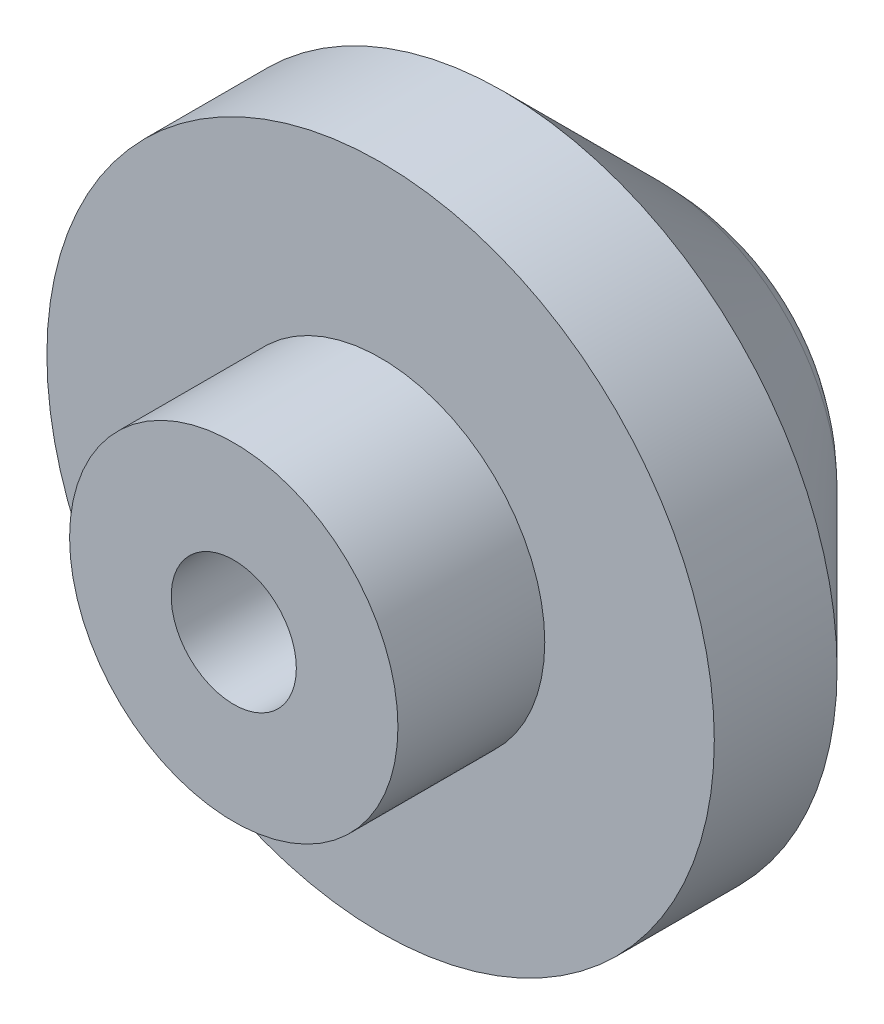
ISO-10303-21;
HEADER;
FILE_DESCRIPTION(('STEP AP214'),'2;1');
FILE_NAME('part.step','',(''),(''),'','','');
FILE_SCHEMA(('AUTOMOTIVE_DESIGN { 1 0 10303 214 1 1 1 1 }'));
ENDSEC;
DATA;
#1=APPLICATION_CONTEXT('core data for automotive mechanical design processes');
#2=APPLICATION_PROTOCOL_DEFINITION('international standard','automotive_design',2000,#1);
#3=PRODUCT_CONTEXT('',#1,'mechanical');
#4=PRODUCT('Part','Part','',(#3));
#5=PRODUCT_RELATED_PRODUCT_CATEGORY('part','',(#4));
#6=PRODUCT_DEFINITION_FORMATION('','',#4);
#7=PRODUCT_DEFINITION_CONTEXT('part definition',#1,'design');
#8=PRODUCT_DEFINITION('design','',#6,#7);
#9=PRODUCT_DEFINITION_SHAPE('','',#8);
#10=(LENGTH_UNIT() NAMED_UNIT(*) SI_UNIT(.MILLI.,.METRE.));
#11=(NAMED_UNIT(*) PLANE_ANGLE_UNIT() SI_UNIT($,.RADIAN.));
#12=(NAMED_UNIT(*) SI_UNIT($,.STERADIAN.) SOLID_ANGLE_UNIT());
#13=UNCERTAINTY_MEASURE_WITH_UNIT(LENGTH_MEASURE(1.E-05),#10,'distance_accuracy_value','');
#14=(GEOMETRIC_REPRESENTATION_CONTEXT(3) GLOBAL_UNCERTAINTY_ASSIGNED_CONTEXT((#13)) GLOBAL_UNIT_ASSIGNED_CONTEXT((#10,
#11,#12)) REPRESENTATION_CONTEXT('',''));
#15=CARTESIAN_POINT('',(0.,0.,0.));
#16=DIRECTION('',(0.,0.,1.));
#17=DIRECTION('',(1.,0.,0.));
#18=AXIS2_PLACEMENT_3D('',#15,#16,#17);
#19=CARTESIAN_POINT('',(0.,0.,2.3749));
#20=DIRECTION('',(0.,0.,-1.));
#21=DIRECTION('',(-1.,0.,0.));
#22=AXIS2_PLACEMENT_3D('',#19,#20,#21);
#23=PLANE('',#22);
#24=CARTESIAN_POINT('',(0.,0.,2.3749));
#25=DIRECTION('',(0.,0.,1.));
#26=DIRECTION('',(1.,0.,0.));
#27=AXIS2_PLACEMENT_3D('',#24,#25,#26);
#28=CIRCLE('',#27,0.595375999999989);
#29=CARTESIAN_POINT('',(0.595375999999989,0.,2.3749));
#30=VERTEX_POINT('',#29);
#31=EDGE_CURVE('E51',#30,#30,#28,.T.);
#32=ORIENTED_EDGE('',*,*,#31,.F.);
#33=EDGE_LOOP('',(#32));
#34=FACE_BOUND('',#33,.T.);
#35=CARTESIAN_POINT('',(0.,0.,2.3749));
#36=DIRECTION('',(0.,0.,1.));
#37=DIRECTION('',(1.,0.,0.));
#38=AXIS2_PLACEMENT_3D('',#35,#36,#37);
#39=CIRCLE('',#38,1.5621);
#40=CARTESIAN_POINT('',(1.5621,0.,2.3749));
#41=VERTEX_POINT('',#40);
#42=EDGE_CURVE('E11',#41,#41,#39,.T.);
#43=ORIENTED_EDGE('',*,*,#42,.T.);
#44=EDGE_LOOP('',(#43));
#45=FACE_BOUND('',#44,.T.);
#46=ADVANCED_FACE('F31',(#34,#45),#23,.F.);
#47=CARTESIAN_POINT('',(0.,0.,5.15564416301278));
#48=DIRECTION('',(0.,0.,1.));
#49=DIRECTION('',(1.,0.,0.));
#50=AXIS2_PLACEMENT_3D('',#47,#48,#49);
#51=CYLINDRICAL_SURFACE('',#50,1.5621);
#52=ORIENTED_EDGE('',*,*,#42,.F.);
#53=EDGE_LOOP('',(#52));
#54=FACE_BOUND('',#53,.T.);
#55=CARTESIAN_POINT('',(0.,0.,0.9779));
#56=DIRECTION('',(0.,0.,1.));
#57=DIRECTION('',(1.,0.,0.));
#58=AXIS2_PLACEMENT_3D('',#55,#56,#57);
#59=CIRCLE('',#58,1.5621);
#60=CARTESIAN_POINT('',(1.5621,0.,0.9779));
#61=VERTEX_POINT('',#60);
#62=EDGE_CURVE('E37',#61,#61,#59,.T.);
#63=ORIENTED_EDGE('',*,*,#62,.T.);
#64=EDGE_LOOP('',(#63));
#65=FACE_BOUND('',#64,.T.);
#66=ADVANCED_FACE('F66',(#54,#65),#51,.T.);
#67=CARTESIAN_POINT('',(0.,1.5621,0.9779));
#68=DIRECTION('',(0.,0.,-1.));
#69=DIRECTION('',(-1.,0.,0.));
#70=AXIS2_PLACEMENT_3D('',#67,#68,#69);
#71=PLANE('',#70);
#72=ORIENTED_EDGE('',*,*,#62,.F.);
#73=EDGE_LOOP('',(#72));
#74=FACE_BOUND('',#73,.T.);
#75=CARTESIAN_POINT('',(0.,0.,0.9779));
#76=DIRECTION('',(0.,0.,1.));
#77=DIRECTION('',(1.,0.,0.));
#78=AXIS2_PLACEMENT_3D('',#75,#76,#77);
#79=CIRCLE('',#78,3.175);
#80=CARTESIAN_POINT('',(3.175,0.,0.9779));
#81=VERTEX_POINT('',#80);
#82=EDGE_CURVE('E61',#81,#81,#79,.T.);
#83=ORIENTED_EDGE('',*,*,#82,.T.);
#84=EDGE_LOOP('',(#83));
#85=FACE_BOUND('',#84,.T.);
#86=ADVANCED_FACE('F68',(#74,#85),#71,.F.);
#87=CARTESIAN_POINT('',(0.,0.,5.15564416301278));
#88=DIRECTION('',(0.,0.,1.));
#89=DIRECTION('',(1.,0.,0.));
#90=AXIS2_PLACEMENT_3D('',#87,#88,#89);
#91=CYLINDRICAL_SURFACE('',#90,3.175);
#92=ORIENTED_EDGE('',*,*,#82,.F.);
#93=EDGE_LOOP('',(#92));
#94=FACE_BOUND('',#93,.T.);
#95=CARTESIAN_POINT('',(0.,0.,-0.1905));
#96=DIRECTION('',(0.,0.,1.));
#97=DIRECTION('',(1.,0.,0.));
#98=AXIS2_PLACEMENT_3D('',#95,#96,#97);
#99=CIRCLE('',#98,3.175);
#100=CARTESIAN_POINT('',(3.175,0.,-0.1905));
#101=VERTEX_POINT('',#100);
#102=EDGE_CURVE('E54',#101,#101,#99,.T.);
#103=ORIENTED_EDGE('',*,*,#102,.T.);
#104=EDGE_LOOP('',(#103));
#105=FACE_BOUND('',#104,.T.);
#106=ADVANCED_FACE('F71',(#94,#105),#91,.T.);
#107=CARTESIAN_POINT('',(0.,0.,-1.67444002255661));
#108=DIRECTION('',(0.,0.,1.));
#109=DIRECTION('',(1.,0.,0.));
#110=AXIS2_PLACEMENT_3D('',#107,#108,#109);
#111=CONICAL_SURFACE('',#110,1.69105997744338,0.78539816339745);
#112=ORIENTED_EDGE('',*,*,#102,.F.);
#113=EDGE_LOOP('',(#112));
#114=FACE_BOUND('',#113,.T.);
#115=CARTESIAN_POINT('',(0.,0.,-1.67444002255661));
#116=DIRECTION('',(0.,0.,1.));
#117=DIRECTION('',(1.,0.,0.));
#118=AXIS2_PLACEMENT_3D('',#115,#116,#117);
#119=CIRCLE('',#118,1.69105997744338);
#120=CARTESIAN_POINT('',(1.69105997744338,0.,-1.67444002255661));
#121=VERTEX_POINT('',#120);
#122=EDGE_CURVE('E50',#121,#121,#119,.T.);
#123=ORIENTED_EDGE('',*,*,#122,.T.);
#124=EDGE_LOOP('',(#123));
#125=FACE_BOUND('',#124,.T.);
#126=ADVANCED_FACE('F77',(#114,#125),#111,.T.);
#127=CARTESIAN_POINT('',(0.,0.,0.0166199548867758));
#128=DIRECTION('',(0.,0.,1.));
#129=DIRECTION('',(0.,1.,0.));
#130=AXIS2_PLACEMENT_3D('',#127,#128,#129);
#131=SPHERICAL_SURFACE('',#130,2.39151995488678);
#132=ORIENTED_EDGE('',*,*,#122,.F.);
#133=EDGE_LOOP('',(#132));
#134=FACE_BOUND('',#133,.T.);
#135=ADVANCED_FACE('F44',(#134),#131,.T.);
#136=CARTESIAN_POINT('',(0.,0.,0.7874));
#137=DIRECTION('',(0.,0.,1.));
#138=DIRECTION('',(1.,0.,0.));
#139=AXIS2_PLACEMENT_3D('',#136,#137,#138);
#140=CONICAL_SURFACE('',#139,0.595376,0.715584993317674);
#141=CARTESIAN_POINT('',(0.,0.,0.102498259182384));
#142=VERTEX_POINT('',#141);
#143=VERTEX_LOOP('',#142);
#144=FACE_BOUND('',#143,.T.);
#145=CARTESIAN_POINT('',(0.,0.,0.7874));
#146=DIRECTION('',(0.,0.,1.));
#147=DIRECTION('',(1.,0.,0.));
#148=AXIS2_PLACEMENT_3D('',#145,#146,#147);
#149=CIRCLE('',#148,0.595376);
#150=CARTESIAN_POINT('',(0.595376,0.,0.7874));
#151=VERTEX_POINT('',#150);
#152=EDGE_CURVE('E48',#151,#151,#149,.T.);
#153=ORIENTED_EDGE('',*,*,#152,.T.);
#154=EDGE_LOOP('',(#153));
#155=FACE_BOUND('',#154,.T.);
#156=ADVANCED_FACE('F40',(#144,#155),#140,.F.);
#157=CARTESIAN_POINT('',(0.,0.,2.3749));
#158=DIRECTION('',(0.,0.,1.));
#159=DIRECTION('',(1.,0.,0.));
#160=AXIS2_PLACEMENT_3D('',#157,#158,#159);
#161=CYLINDRICAL_SURFACE('',#160,0.595375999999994);
#162=ORIENTED_EDGE('',*,*,#152,.F.);
#163=EDGE_LOOP('',(#162));
#164=FACE_BOUND('',#163,.T.);
#165=ORIENTED_EDGE('',*,*,#31,.T.);
#166=EDGE_LOOP('',(#165));
#167=FACE_BOUND('',#166,.T.);
#168=ADVANCED_FACE('F43',(#164,#167),#161,.F.);
#169=CLOSED_SHELL('',(#46,#66,#86,#106,#126,#135,#156,#168));
#170=MANIFOLD_SOLID_BREP('B2',#169);
#171=ADVANCED_BREP_SHAPE_REPRESENTATION('',(#18,#170),#14);
#172=SHAPE_DEFINITION_REPRESENTATION(#9,#171);
ENDSEC;
END-ISO-10303-21;
